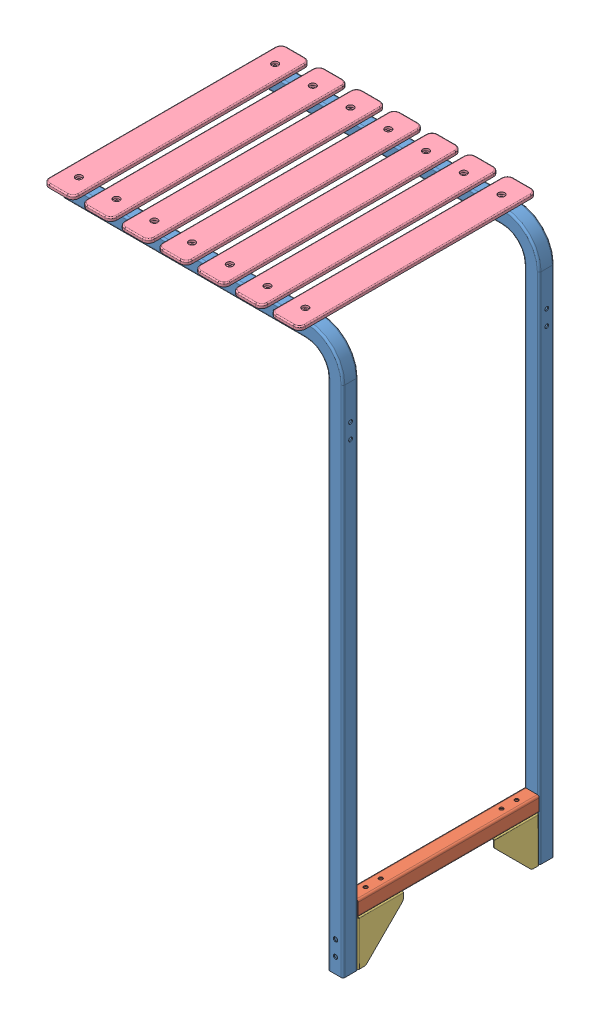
SolidWorks assembly Support_Frame.SLDASM, configuration Default (file format 11000). Lengths in mm.
Overall size (482.2 933.1 400).
12 component instances, 4 part files, 15 mates.
Components (placement in the parent):
- Support_Leg-1: Support_Leg.SLDPRT [Long Arm] at origin size (469.9 927.1 25.4)
- Brace_Cross_Bar-1: Brace_Cross_Bar.SLDPRT [Plain] at (457.2 -825.5 -165.1) size (25.4 25.4 304.8)
- Brace_Corner-1: Brace_Corner.SLDPRT [Default] at (469.9 -838.2 -12.7) x (0 -1 0) z (-1 0 0) size (76.2 76.2 25.4)
- Support_Leg-2: Support_Leg.SLDPRT [Long Arm] at (0 0 -330.2) size (469.9 927.1 25.4)
- Brace_Corner-2: Brace_Corner.SLDPRT [Default] at (469.9 -838.2 -317.5) x (0 0 1) z (-1 0 0) size (76.2 76.2 25.4)
- Plank-1: Plank.SLDPRT [Wood] at (12.7 12.7 -165.1) size (50 6 400)
- Plank-2: Plank.SLDPRT [Wood] at (76.2 12.7 -165.1) size (50 6 400)
- Plank-3: Plank.SLDPRT [Wood] at (139.7 12.7 -165.1) size (50 6 400)
- Plank-4: Plank.SLDPRT [Wood] at (203.2 12.7 -165.1) size (50 6 400)
- Plank-5: Plank.SLDPRT [Wood] at (266.7 12.7 -165.1) size (50 6 400)
- Plank-6: Plank.SLDPRT [Wood] at (330.2 12.7 -165.1) size (50 6 400)
- Plank-7: Plank.SLDPRT [Wood] at (393.7 12.7 -165.1) size (50 6 400)
Mates (geometry in assembly coordinates):
- Coincident1: coincident: plane of Support_Leg-1 through (406.4 -12.7 -12.7) normal (0 0 -1); plane of Brace_Corner-1 through (444.5 -914.4 -12.7) normal (0 0 1)
- Coincident2: coincident: plane of Support_Leg-1 through (469.9 -914.4 12.7) normal (0 -1 0); plane of Brace_Corner-1 through (444.5 -914.4 -12.7) normal (0 -1 0)
- Coincident3: coincident: plane of Support_Leg-1 through (469.9 -50.8 12.7) normal (1 0 0); plane of Brace_Corner-1 through (469.9 -838.2 -12.7) normal (1 0 0)
- Coincident4: coincident: plane of Brace_Cross_Bar-1 through (469.9 -838.2 -12.7) normal (0 -1 0); plane of Brace_Corner-1 through (444.5 -838.2 368.3) normal (0 1 0)
- Coincident5: coincident: plane of Support_Leg-1 through (406.4 -12.7 -12.7) normal (0 0 -1); plane of Brace_Cross_Bar-1 through (444.5 -838.2 -12.7) normal (0 0 1)
- Coincident6: coincident: plane of Brace_Cross_Bar-1 through (469.9 -838.2 -12.7) normal (1 0 0); plane of Brace_Corner-1 through (469.9 -838.2 -12.7) normal (1 0 0)
- Coincident7: coincident: plane of Brace_Cross_Bar-1 through (444.5 -838.2 -317.5) normal (0 0 -1); plane of Support_Leg-2 through (406.4 12.7 -317.5) normal (0 0 1)
- Coincident8: coincident: plane of Brace_Cross_Bar-1 through (469.9 -838.2 -12.7) normal (1 0 0); plane of Support_Leg-2 through (469.9 -50.8 -317.5) normal (1 0 0)
- Coincident9: coincident: plane of Support_Leg-1 through (469.9 -914.4 12.7) normal (0 -1 0); plane of Support_Leg-2 through (469.9 -914.4 -317.5) normal (0 -1 0)
- Coincident10: coincident: plane of Support_Leg-2 through (406.4 12.7 -317.5) normal (0 0 1); plane of Brace_Corner-2 through (444.5 -457.2 -317.5) normal (0 0 -1)
- Coincident11: coincident: plane of Brace_Cross_Bar-1 through (469.9 -838.2 -12.7) normal (0 -1 0); plane of Brace_Corner-2 through (444.5 -838.2 -241.3) normal (0 1 0)
- Coincident12: coincident: plane of Support_Leg-2 through (469.9 -50.8 -317.5) normal (1 0 0); plane of Brace_Corner-2 through (469.9 -838.2 -317.5) normal (1 0 0)
- Concentric1: concentric: cylinder of Support_Leg-1 through (12.7 -914.401 0) axis (0 1 0) radius 3.175; cylinder of Plank-1 through (12.7 18.7 0) axis (0 1 0) radius 2.75
- Coincident13: coincident: plane of Support_Leg-1 through (406.4 12.7 12.7) normal (0 1 0); plane of Plank-1 through (-12.3 12.7 34.9) normal (0 -1 0)
- Concentric2: concentric: cylinder of Support_Leg-2 through (12.7 -914.401 -330.2) axis (0 1 0) radius 3.175; cylinder of Plank-1 through (12.7 18.7 -330.2) axis (0 1 0) radius 2.75
